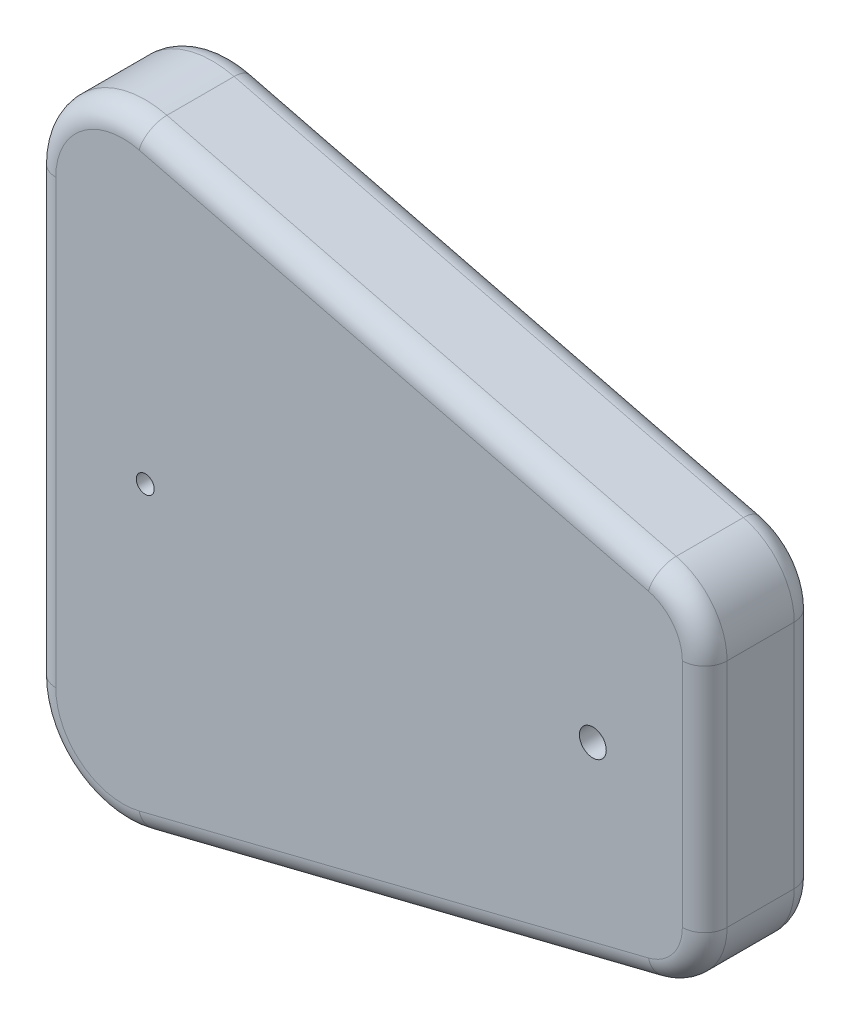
from build123d import *

# Parameters (mm, degrees)
BOSS_EXTRU_1_DEPTH      = 50
CONG_1_R                = 10
ESQUISSE2_R             = 4
ESQUISSE2_R_2           = 6
ENL_V_MAT_EXTRU_1_DEPTH = 30


with BuildPart() as part:
    # Esquisse1 → Boss.-Extru.1 (new body)
    with BuildSketch(Plane.XY):
        with BuildLine():
            Line((49.701425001, -137.57464375), (277.276068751, -80.680982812))
            ThreePointArc((277.276068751, -80.680982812), (293.64616314, -70.03907409), (300, -51.576707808))
            Line((300, -51.576707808), (300, 51.576707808))
            ThreePointArc((300, 51.576707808), (293.64616314, 70.03907409), (277.276068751, 80.680982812))
            Line((277.276068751, 80.680982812), (49.701425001, 137.57464375))
            ThreePointArc((49.701425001, 137.57464375), (15.383511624, 130.297161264), (0, 98.768943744))
            Line((0, 98.768943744), (0, -98.768943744))
            ThreePointArc((0, -98.768943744), (15.383511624, -130.297161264), (49.701425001, -137.57464375))
        make_face()
    extrude(amount=BOSS_EXTRU_1_DEPTH)

    # Cong_1
    cong_1_edges = [part.edges().sort_by_distance(p)[0] for p in [
        (15.383511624, -130.297161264, 50),
        (0, 0, 0),
        (15.383511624, 130.297161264, 0),
        (163.488746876, -109.127813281, 50),
        (293.64616314, -70.03907409, 50),
        (300, 0, 50),
        (293.64616314, 70.03907409, 50),
        (163.488746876, 109.127813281, 50),
        (15.383511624, 130.297161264, 50),
        (0, 0, 50),
        (163.488746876, 109.127813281, 0),
        (293.64616314, 70.03907409, 0),
        (300, 0, 0),
        (293.64616314, -70.03907409, 0),
        (163.488746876, -109.127813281, 0),
        (15.383511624, -130.297161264, 0),
    ]]
    fillet(cong_1_edges, radius=CONG_1_R)

    # Esquisse2 → Enl_v. mat.-Extru.1 (cut)
    with BuildSketch(Plane.XY.offset(50)):
        with Locations((50, 0)):
            Circle(ESQUISSE2_R)
        with Locations((250, 0)):
            Circle(ESQUISSE2_R_2)
    extrude(amount=-ENL_V_MAT_EXTRU_1_DEPTH, mode=Mode.SUBTRACT)


solid = part.part
